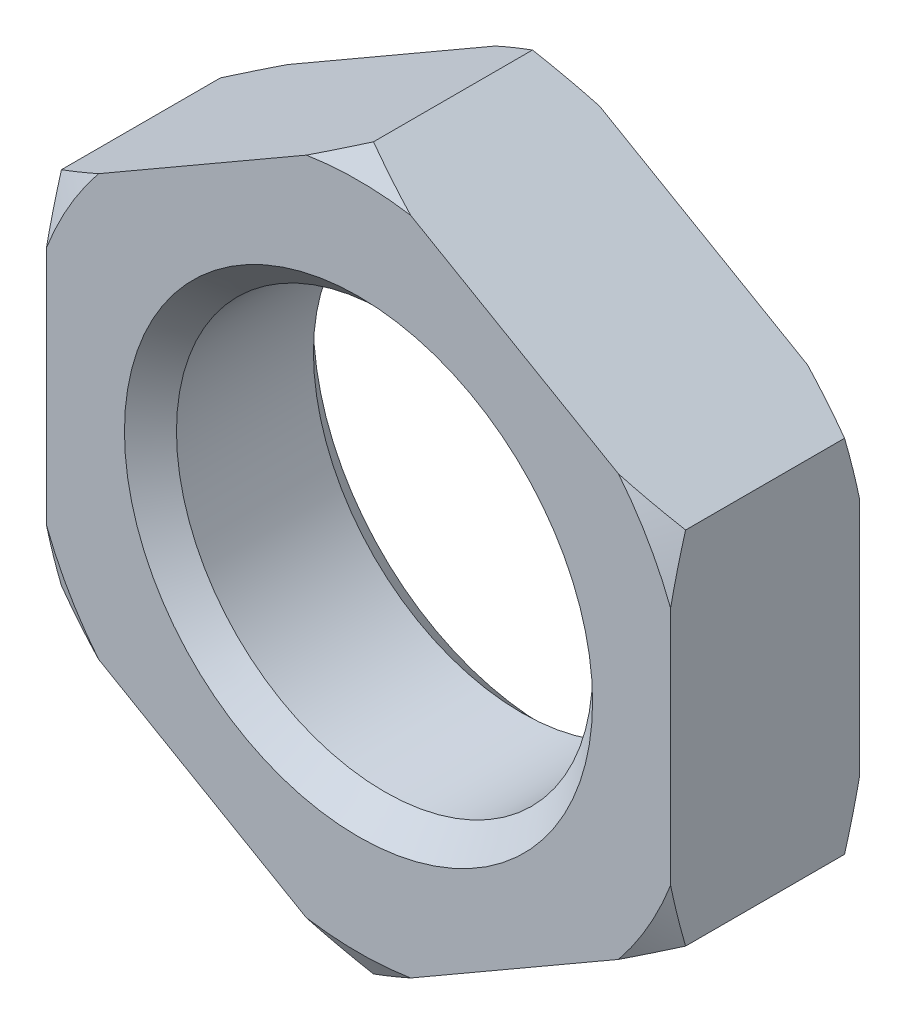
from build123d import *

# Parameters (mm, degrees)
SKETCH1_R           = 12
BOSS_EXTRUDE1_DEPTH = 5.45
CHAMFER1_SIZE       = 1.5


with BuildPart() as part:
    # Sketch1 → Boss-Extrude1 (new, symmetric)
    with BuildSketch(Plane.XY):
        Polygon((0, 20.784609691), (-18, 10.392304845), (-18, -10.392304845), (0, -20.784609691), (18, -10.392304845), (18, 10.392304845), align=None)
        Circle(SKETCH1_R, mode=Mode.SUBTRACT)
    extrude(amount=BOSS_EXTRUDE1_DEPTH, both=True)

    # Sketch3 → Cut-Revolve1 (revolve, cut)
    with BuildSketch(Plane(origin=(0, 0, 0), x_dir=(0, 0, -1), z_dir=(1, 0, 0))):
        Polygon((-5.45, 20.784609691), (-5.45, 19.284609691), (-4.583974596, 20.784609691), align=None)
    cut_revolve1 = revolve(axis=Axis((0, 0, -7.477018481), (0, 0, 1)), mode=Mode.SUBTRACT)

    # Mirror1: Cut-Revolve1 across plane
    add(cut_revolve1.mirror(Plane.XY), mode=Mode.SUBTRACT)

    # Chamfer1
    chamfer1_edges = [part.edges().sort_by_distance(p)[0] for p in [
        (-12, 0, -5.45),
        (-12, 0, 5.45),
    ]]
    chamfer(chamfer1_edges, length=CHAMFER1_SIZE)


solid = part.part
